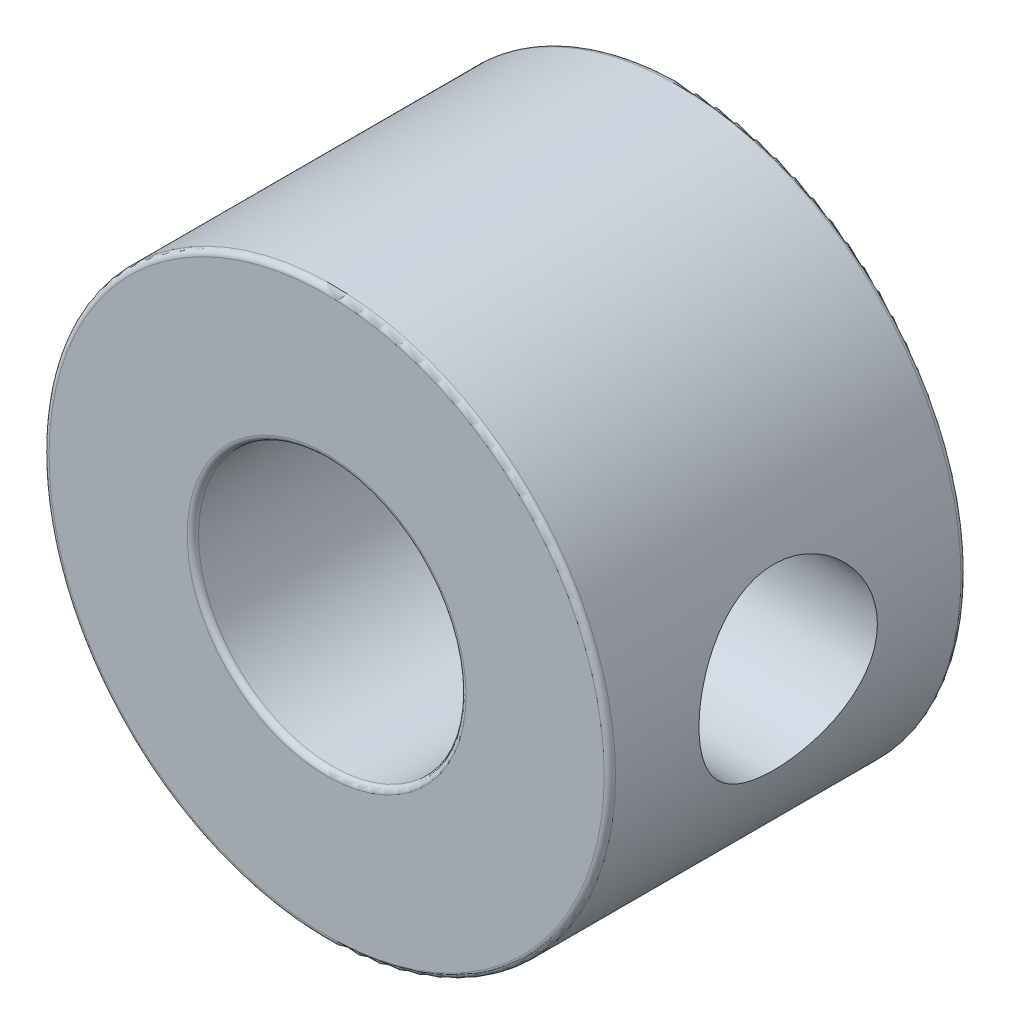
ISO-10303-21;
HEADER;
FILE_DESCRIPTION(('STEP AP214'),'2;1');
FILE_NAME('part.step','',(''),(''),'','','');
FILE_SCHEMA(('AUTOMOTIVE_DESIGN { 1 0 10303 214 1 1 1 1 }'));
ENDSEC;
DATA;
#1=APPLICATION_CONTEXT('core data for automotive mechanical design processes');
#2=APPLICATION_PROTOCOL_DEFINITION('international standard','automotive_design',2000,#1);
#3=PRODUCT_CONTEXT('',#1,'mechanical');
#4=PRODUCT('Part','Part','',(#3));
#5=PRODUCT_RELATED_PRODUCT_CATEGORY('part','',(#4));
#6=PRODUCT_DEFINITION_FORMATION('','',#4);
#7=PRODUCT_DEFINITION_CONTEXT('part definition',#1,'design');
#8=PRODUCT_DEFINITION('design','',#6,#7);
#9=PRODUCT_DEFINITION_SHAPE('','',#8);
#10=(LENGTH_UNIT() NAMED_UNIT(*) SI_UNIT(.MILLI.,.METRE.));
#11=(NAMED_UNIT(*) PLANE_ANGLE_UNIT() SI_UNIT($,.RADIAN.));
#12=(NAMED_UNIT(*) SI_UNIT($,.STERADIAN.) SOLID_ANGLE_UNIT());
#13=UNCERTAINTY_MEASURE_WITH_UNIT(LENGTH_MEASURE(1.E-05),#10,'distance_accuracy_value','');
#14=(GEOMETRIC_REPRESENTATION_CONTEXT(3) GLOBAL_UNCERTAINTY_ASSIGNED_CONTEXT((#13)) GLOBAL_UNIT_ASSIGNED_CONTEXT((#10,
#11,#12)) REPRESENTATION_CONTEXT('',''));
#15=CARTESIAN_POINT('',(0.,0.,0.));
#16=DIRECTION('',(0.,0.,1.));
#17=DIRECTION('',(1.,0.,0.));
#18=AXIS2_PLACEMENT_3D('',#15,#16,#17);
#19=CARTESIAN_POINT('',(0.,0.,8.));
#20=DIRECTION('',(0.,0.,1.));
#21=DIRECTION('',(1.,0.,0.));
#22=AXIS2_PLACEMENT_3D('',#19,#20,#21);
#23=PLANE('',#22);
#24=CARTESIAN_POINT('',(0.,0.,8.));
#25=DIRECTION('',(0.,0.,1.));
#26=DIRECTION('',(1.,0.,0.));
#27=AXIS2_PLACEMENT_3D('',#24,#25,#26);
#28=CIRCLE('',#27,3.127);
#29=CARTESIAN_POINT('',(3.127,0.,8.));
#30=VERTEX_POINT('',#29);
#31=EDGE_CURVE('E45',#30,#30,#28,.F.);
#32=ORIENTED_EDGE('',*,*,#31,.T.);
#33=EDGE_LOOP('',(#32));
#34=FACE_BOUND('',#33,.T.);
#35=CARTESIAN_POINT('',(0.,0.,8.));
#36=DIRECTION('',(0.,0.,1.));
#37=DIRECTION('',(1.,0.,0.));
#38=AXIS2_PLACEMENT_3D('',#35,#36,#37);
#39=CIRCLE('',#38,6.223);
#40=CARTESIAN_POINT('',(6.223,0.,8.));
#41=VERTEX_POINT('',#40);
#42=EDGE_CURVE('E49',#41,#41,#39,.T.);
#43=ORIENTED_EDGE('',*,*,#42,.T.);
#44=EDGE_LOOP('',(#43));
#45=FACE_BOUND('',#44,.T.);
#46=ADVANCED_FACE('F34',(#34,#45),#23,.T.);
#47=CARTESIAN_POINT('',(0.,0.,0.));
#48=DIRECTION('',(0.,0.,1.));
#49=DIRECTION('',(1.,0.,0.));
#50=AXIS2_PLACEMENT_3D('',#47,#48,#49);
#51=PLANE('',#50);
#52=CARTESIAN_POINT('',(0.,0.,0.));
#53=DIRECTION('',(0.,0.,1.));
#54=DIRECTION('',(1.,0.,0.));
#55=AXIS2_PLACEMENT_3D('',#52,#53,#54);
#56=CIRCLE('',#55,3.127);
#57=CARTESIAN_POINT('',(3.127,0.,0.));
#58=VERTEX_POINT('',#57);
#59=EDGE_CURVE('E60',#58,#58,#56,.T.);
#60=ORIENTED_EDGE('',*,*,#59,.T.);
#61=EDGE_LOOP('',(#60));
#62=FACE_BOUND('',#61,.T.);
#63=CARTESIAN_POINT('',(0.,0.,0.));
#64=DIRECTION('',(0.,0.,1.));
#65=DIRECTION('',(1.,0.,0.));
#66=AXIS2_PLACEMENT_3D('',#63,#64,#65);
#67=CIRCLE('',#66,6.223);
#68=CARTESIAN_POINT('',(6.223,0.,0.));
#69=VERTEX_POINT('',#68);
#70=EDGE_CURVE('E63',#69,#69,#67,.F.);
#71=ORIENTED_EDGE('',*,*,#70,.T.);
#72=EDGE_LOOP('',(#71));
#73=FACE_BOUND('',#72,.T.);
#74=ADVANCED_FACE('F97',(#62,#73),#51,.F.);
#75=CARTESIAN_POINT('',(0.,0.,8.));
#76=DIRECTION('',(0.,0.,-1.));
#77=DIRECTION('',(-1.,0.,0.));
#78=AXIS2_PLACEMENT_3D('',#75,#76,#77);
#79=CYLINDRICAL_SURFACE('',#78,6.35);
#80=CARTESIAN_POINT('',(0.,0.,0.127));
#81=DIRECTION('',(0.,0.,1.));
#82=DIRECTION('',(1.,0.,0.));
#83=AXIS2_PLACEMENT_3D('',#80,#81,#82);
#84=CIRCLE('',#83,6.35);
#85=CARTESIAN_POINT('',(6.35,0.,0.127));
#86=VERTEX_POINT('',#85);
#87=EDGE_CURVE('E10',#86,#86,#84,.T.);
#88=ORIENTED_EDGE('',*,*,#87,.T.);
#89=EDGE_LOOP('',(#88));
#90=FACE_BOUND('',#89,.T.);
#91=CARTESIAN_POINT('',(0.,0.,7.873));
#92=DIRECTION('',(0.,0.,1.));
#93=DIRECTION('',(1.,0.,0.));
#94=AXIS2_PLACEMENT_3D('',#91,#92,#93);
#95=CIRCLE('',#94,6.35);
#96=CARTESIAN_POINT('',(6.35,0.,7.873));
#97=VERTEX_POINT('',#96);
#98=EDGE_CURVE('E41',#97,#97,#95,.F.);
#99=ORIENTED_EDGE('',*,*,#98,.T.);
#100=EDGE_LOOP('',(#99));
#101=FACE_BOUND('',#100,.T.);
#102=CARTESIAN_POINT('',(6.35,0.,2.));
#103=CARTESIAN_POINT('',(6.34999954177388,-0.109459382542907,2.00000058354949));
#104=CARTESIAN_POINT('',(6.34714311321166,-0.218925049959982,2.00901558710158));
#105=CARTESIAN_POINT('',(6.33602827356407,-0.434652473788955,2.0447410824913));
#106=CARTESIAN_POINT('',(6.32776871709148,-0.540913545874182,2.07145532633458));
#107=CARTESIAN_POINT('',(6.30674936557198,-0.747089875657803,2.14158716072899));
#108=CARTESIAN_POINT('',(6.2939966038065,-0.847014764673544,2.1849786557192));
#109=CARTESIAN_POINT('',(6.26530583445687,-1.03817017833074,2.287121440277));
#110=CARTESIAN_POINT('',(6.24936730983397,-1.12939928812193,2.34587522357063));
#111=CARTESIAN_POINT('',(6.21543683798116,-1.30343118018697,2.47901136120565));
#112=CARTESIAN_POINT('',(6.19739963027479,-1.38592345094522,2.55378802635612));
#113=CARTESIAN_POINT('',(6.16156531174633,-1.53742831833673,2.71600787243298));
#114=CARTESIAN_POINT('',(6.14376824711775,-1.60643835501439,2.80345345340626));
#115=CARTESIAN_POINT('',(6.10994220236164,-1.73071363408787,2.99122929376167));
#116=CARTESIAN_POINT('',(6.09396900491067,-1.78558916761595,3.09182847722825));
#117=CARTESIAN_POINT('',(6.06628083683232,-1.87751386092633,3.30141198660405));
#118=CARTESIAN_POINT('',(6.05456472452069,-1.91456780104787,3.41039405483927));
#119=CARTESIAN_POINT('',(6.03719105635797,-1.96865797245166,3.63014256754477));
#120=CARTESIAN_POINT('',(6.03135942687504,-1.98627089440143,3.74075291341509));
#121=CARTESIAN_POINT('',(6.02589838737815,-2.00278087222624,3.96350056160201));
#122=CARTESIAN_POINT('',(6.02626729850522,-2.00168299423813,4.0756374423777));
#123=CARTESIAN_POINT('',(6.03301213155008,-1.98125320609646,4.29346796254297));
#124=CARTESIAN_POINT('',(6.03914580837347,-1.96265658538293,4.39923933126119));
#125=CARTESIAN_POINT('',(6.05633519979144,-1.90895021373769,4.60607693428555));
#126=CARTESIAN_POINT('',(6.06739144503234,-1.8738386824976,4.7071426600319));
#127=CARTESIAN_POINT('',(6.09336435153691,-1.78758434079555,4.90344233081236));
#128=CARTESIAN_POINT('',(6.10833567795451,-1.73621215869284,4.99856794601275));
#129=CARTESIAN_POINT('',(6.14042705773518,-1.6190540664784,5.17908872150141));
#130=CARTESIAN_POINT('',(6.15754767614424,-1.55326436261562,5.26448131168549));
#131=CARTESIAN_POINT('',(6.19297824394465,-1.40553948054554,5.42726612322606));
#132=CARTESIAN_POINT('',(6.21130656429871,-1.32299795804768,5.5041051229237));
#133=CARTESIAN_POINT('',(6.24638917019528,-1.14597287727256,5.64298607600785));
#134=CARTESIAN_POINT('',(6.26314333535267,-1.05148840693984,5.70502689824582));
#135=CARTESIAN_POINT('',(6.29337063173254,-0.852181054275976,5.81293320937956));
#136=CARTESIAN_POINT('',(6.30681635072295,-0.747281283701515,5.85866488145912));
#137=CARTESIAN_POINT('',(6.32871380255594,-0.530755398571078,5.93166785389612));
#138=CARTESIAN_POINT('',(6.33716707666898,-0.419131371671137,5.9589448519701));
#139=CARTESIAN_POINT('',(6.34787832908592,-0.197020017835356,5.99331746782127));
#140=CARTESIAN_POINT('',(6.35036604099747,-0.0866594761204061,6.0011618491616));
#141=CARTESIAN_POINT('',(6.34954641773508,0.133813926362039,5.99856019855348));
#142=CARTESIAN_POINT('',(6.34623994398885,0.243926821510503,5.98811688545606));
#143=CARTESIAN_POINT('',(6.33435451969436,0.457878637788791,5.94983646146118));
#144=CARTESIAN_POINT('',(6.325911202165,0.561805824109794,5.92244650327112));
#145=CARTESIAN_POINT('',(6.30474229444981,0.763559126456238,5.85159744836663));
#146=CARTESIAN_POINT('',(6.29201617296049,0.861384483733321,5.80813635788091));
#147=CARTESIAN_POINT('',(6.26319856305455,1.05083641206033,5.70518375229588));
#148=CARTESIAN_POINT('',(6.24703194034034,1.14225110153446,5.64532394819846));
#149=CARTESIAN_POINT('',(6.21318025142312,1.31398832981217,5.51171388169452));
#150=CARTESIAN_POINT('',(6.19549476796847,1.394307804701,5.43795979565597));
#151=CARTESIAN_POINT('',(6.15970098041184,1.54493496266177,5.27513269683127));
#152=CARTESIAN_POINT('',(6.1416043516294,1.61470885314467,5.18556218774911));
#153=CARTESIAN_POINT('',(6.10778048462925,1.73828550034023,4.99559091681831));
#154=CARTESIAN_POINT('',(6.09205321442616,1.79208847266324,4.89519030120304));
#155=CARTESIAN_POINT('',(6.06492137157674,1.88186972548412,4.68659077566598));
#156=CARTESIAN_POINT('',(6.05350088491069,1.91791378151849,4.57842236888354));
#157=CARTESIAN_POINT('',(6.03638058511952,1.97114343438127,4.35711703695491));
#158=CARTESIAN_POINT('',(6.03067855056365,1.98833635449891,4.24398205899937));
#159=CARTESIAN_POINT('',(6.02587471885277,2.00284439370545,4.02154245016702));
#160=CARTESIAN_POINT('',(6.02648176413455,2.00103634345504,3.91230059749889));
#161=CARTESIAN_POINT('',(6.03351893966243,1.97971522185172,3.69575938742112));
#162=CARTESIAN_POINT('',(6.0399487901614,1.96020300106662,3.58845993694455));
#163=CARTESIAN_POINT('',(6.05770205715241,1.90461841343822,3.3804445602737));
#164=CARTESIAN_POINT('',(6.06895005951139,1.86880073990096,3.27965365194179));
#165=CARTESIAN_POINT('',(6.0950519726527,1.78182311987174,3.08543184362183));
#166=CARTESIAN_POINT('',(6.10990662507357,1.7306600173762,2.99200246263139));
#167=CARTESIAN_POINT('',(6.14228296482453,1.61207166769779,2.81114466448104));
#168=CARTESIAN_POINT('',(6.15988705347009,1.54408200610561,2.724101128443));
#169=CARTESIAN_POINT('',(6.19540382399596,1.39475914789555,2.56237483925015));
#170=CARTESIAN_POINT('',(6.21331658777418,1.31342235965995,2.48769542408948));
#171=CARTESIAN_POINT('',(6.24814930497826,1.1364502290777,2.35032141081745));
#172=CARTESIAN_POINT('',(6.26501620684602,1.04042842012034,2.28810970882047));
#173=CARTESIAN_POINT('',(6.29518499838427,0.8387590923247,2.1807921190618));
#174=CARTESIAN_POINT('',(6.30848823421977,0.733115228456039,2.13567976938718));
#175=CARTESIAN_POINT('',(6.32915110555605,0.523924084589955,2.06696118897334));
#176=CARTESIAN_POINT('',(6.33690087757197,0.420884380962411,2.04192397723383));
#177=CARTESIAN_POINT('',(6.34732501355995,0.211898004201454,2.00844484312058));
#178=CARTESIAN_POINT('',(6.35000044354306,0.105951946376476,1.99999943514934));
#179=CARTESIAN_POINT('',(6.35,0.,2.));
#180=B_SPLINE_CURVE_WITH_KNOTS('',3,(#102,#103,#104,#105,#106,#107,#108,#109,#110,#111,#112,
#113,#114,#115,#116,#117,#118,#119,#120,#121,#122,#123,#124,#125,#126,#127,#128,#129,#130,#131,
#132,#133,#134,#135,#136,#137,#138,#139,#140,#141,#142,#143,#144,#145,#146,#147,#148,#149,#150,
#151,#152,#153,#154,#155,#156,#157,#158,#159,#160,#161,#162,#163,#164,#165,#166,#167,#168,#169,
#170,#171,#172,#173,#174,#175,#176,#177,#178,#179),.UNSPECIFIED.,.T.,.F.,(4,2,2,2,2,2,2,2,2,2,2,
2,2,2,2,2,2,2,2,2,2,2,2,2,2,2,2,2,2,2,2,2,2,2,2,2,2,2,4),(0.,0.327988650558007,
0.656046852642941,0.983593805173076,1.31119396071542,1.6480406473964,1.98495123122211,
2.33034249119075,2.67564105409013,3.01039595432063,3.34506021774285,3.66626171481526,
3.98749784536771,4.31348397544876,4.63955598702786,4.9807199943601,5.32191007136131,
5.66583848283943,6.00966066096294,6.34001323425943,6.67031669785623,6.99225602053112,
7.31423529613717,7.64414085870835,7.97413734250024,8.31743010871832,8.6607182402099,
9.00272515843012,9.34459916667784,9.67076879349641,9.99692275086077,10.3181482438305,
10.6394398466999,10.9734721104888,11.3075944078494,11.6528624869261,11.9979999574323,
12.3155454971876,12.6330243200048),.UNSPECIFIED.);
#181=CARTESIAN_POINT('',(6.35,0.,2.));
#182=VERTEX_POINT('',#181);
#183=EDGE_CURVE('E66',#182,#182,#180,.T.);
#184=ORIENTED_EDGE('',*,*,#183,.T.);
#185=EDGE_LOOP('',(#184));
#186=FACE_BOUND('',#185,.T.);
#187=ADVANCED_FACE('F93',(#90,#101,#186),#79,.T.);
#188=CARTESIAN_POINT('',(0.,0.,8.));
#189=DIRECTION('',(0.,0.,-1.));
#190=DIRECTION('',(-1.,0.,0.));
#191=AXIS2_PLACEMENT_3D('',#188,#189,#190);
#192=CYLINDRICAL_SURFACE('',#191,3.);
#193=CARTESIAN_POINT('',(0.,0.,0.127));
#194=DIRECTION('',(0.,0.,1.));
#195=DIRECTION('',(1.,0.,0.));
#196=AXIS2_PLACEMENT_3D('',#193,#194,#195);
#197=CIRCLE('',#196,3.);
#198=CARTESIAN_POINT('',(3.,0.,0.127));
#199=VERTEX_POINT('',#198);
#200=EDGE_CURVE('E54',#199,#199,#197,.F.);
#201=ORIENTED_EDGE('',*,*,#200,.T.);
#202=EDGE_LOOP('',(#201));
#203=FACE_BOUND('',#202,.T.);
#204=CARTESIAN_POINT('',(0.,0.,7.873));
#205=DIRECTION('',(0.,0.,1.));
#206=DIRECTION('',(1.,0.,0.));
#207=AXIS2_PLACEMENT_3D('',#204,#205,#206);
#208=CIRCLE('',#207,3.);
#209=CARTESIAN_POINT('',(3.,0.,7.873));
#210=VERTEX_POINT('',#209);
#211=EDGE_CURVE('E57',#210,#210,#208,.T.);
#212=ORIENTED_EDGE('',*,*,#211,.T.);
#213=EDGE_LOOP('',(#212));
#214=FACE_BOUND('',#213,.T.);
#215=CARTESIAN_POINT('',(3.,0.,2.));
#216=CARTESIAN_POINT('',(3.0000004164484,-0.100484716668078,1.99999945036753));
#217=CARTESIAN_POINT('',(2.99490802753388,-0.200969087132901,2.0076139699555));
#218=CARTESIAN_POINT('',(2.97504652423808,-0.398733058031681,2.03759686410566));
#219=CARTESIAN_POINT('',(2.96027281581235,-0.496011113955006,2.05997224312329));
#220=CARTESIAN_POINT('',(2.92250482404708,-0.684212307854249,2.11810771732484));
#221=CARTESIAN_POINT('',(2.89954905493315,-0.775162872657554,2.15380514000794));
#222=CARTESIAN_POINT('',(2.8472613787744,-0.94941529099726,2.2370633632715));
#223=CARTESIAN_POINT('',(2.8179285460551,-1.03271603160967,2.28462588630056));
#224=CARTESIAN_POINT('',(2.75227329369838,-1.19728470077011,2.39465693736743));
#225=CARTESIAN_POINT('',(2.71556897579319,-1.27778030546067,2.45804786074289));
#226=CARTESIAN_POINT('',(2.63982313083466,-1.42772804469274,2.59573004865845));
#227=CARTESIAN_POINT('',(2.60077830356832,-1.49716405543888,2.67003692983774));
#228=CARTESIAN_POINT('',(2.51728264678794,-1.63422297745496,2.84105236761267));
#229=CARTESIAN_POINT('',(2.47295067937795,-1.6998318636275,2.93944565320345));
#230=CARTESIAN_POINT('',(2.3908414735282,-1.81350357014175,3.14836337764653));
#231=CARTESIAN_POINT('',(2.35305295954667,-1.86159673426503,3.25886640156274));
#232=CARTESIAN_POINT('',(2.2997626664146,-1.92674035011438,3.45671129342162));
#233=CARTESIAN_POINT('',(2.28097627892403,-1.94874447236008,3.54152845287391));
#234=CARTESIAN_POINT('',(2.25257969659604,-1.98150617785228,3.71474450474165));
#235=CARTESIAN_POINT('',(2.24295368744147,-1.99228314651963,3.80313694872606));
#236=CARTESIAN_POINT('',(2.23436605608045,-2.00191364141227,3.98147477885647));
#237=CARTESIAN_POINT('',(2.23544802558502,-2.00071842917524,4.0714250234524));
#238=CARTESIAN_POINT('',(2.24819775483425,-1.98637581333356,4.24963497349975));
#239=CARTESIAN_POINT('',(2.25987448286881,-1.97321828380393,4.33789318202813));
#240=CARTESIAN_POINT('',(2.29127185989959,-1.93664994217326,4.50646705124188));
#241=CARTESIAN_POINT('',(2.31061488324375,-1.91371711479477,4.58696133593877));
#242=CARTESIAN_POINT('',(2.35509622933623,-1.85870118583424,4.74302369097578));
#243=CARTESIAN_POINT('',(2.38023645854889,-1.82661507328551,4.81859013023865));
#244=CARTESIAN_POINT('',(2.43964196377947,-1.74673818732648,4.97902539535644));
#245=CARTESIAN_POINT('',(2.47472317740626,-1.69708052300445,5.06265990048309));
#246=CARTESIAN_POINT('',(2.54691537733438,-1.58668960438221,5.22138339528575));
#247=CARTESIAN_POINT('',(2.58402882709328,-1.52594268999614,5.29646165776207));
#248=CARTESIAN_POINT('',(2.66543343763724,-1.37981165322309,5.45254254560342));
#249=CARTESIAN_POINT('',(2.7095474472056,-1.29193938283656,5.53133404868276));
#250=CARTESIAN_POINT('',(2.79218100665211,-1.10200799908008,5.67319649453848));
#251=CARTESIAN_POINT('',(2.83070577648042,-0.999962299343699,5.73628214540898));
#252=CARTESIAN_POINT('',(2.89145404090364,-0.804857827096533,5.83347771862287));
#253=CARTESIAN_POINT('',(2.91539261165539,-0.713957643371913,5.87084336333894));
#254=CARTESIAN_POINT('',(2.95507719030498,-0.526036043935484,5.93210492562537));
#255=CARTESIAN_POINT('',(2.97083012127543,-0.429019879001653,5.95601222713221));
#256=CARTESIAN_POINT('',(2.99275882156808,-0.230985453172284,5.989161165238));
#257=CARTESIAN_POINT('',(2.99889322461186,-0.129951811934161,5.99833946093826));
#258=CARTESIAN_POINT('',(3.00083114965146,0.0724415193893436,6.00124708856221));
#259=CARTESIAN_POINT('',(2.99663539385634,0.173801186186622,5.99497750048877));
#260=CARTESIAN_POINT('',(2.97899589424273,0.366455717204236,5.96837594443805));
#261=CARTESIAN_POINT('',(2.96622246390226,0.457957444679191,5.94906270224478));
#262=CARTESIAN_POINT('',(2.93318449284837,0.636116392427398,5.89840431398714));
#263=CARTESIAN_POINT('',(2.91291875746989,0.722772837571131,5.86705724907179));
#264=CARTESIAN_POINT('',(2.86496352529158,0.894664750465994,5.79134770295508));
#265=CARTESIAN_POINT('',(2.83689870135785,0.979496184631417,5.74631184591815));
#266=CARTESIAN_POINT('',(2.77601855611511,1.14068302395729,5.64556671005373));
#267=CARTESIAN_POINT('',(2.74320030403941,1.21703314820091,5.58985083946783));
#268=CARTESIAN_POINT('',(2.6695454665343,1.37185445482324,5.45939213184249));
#269=CARTESIAN_POINT('',(2.62826156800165,1.44875187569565,5.38303373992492));
#270=CARTESIAN_POINT('',(2.54571173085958,1.58933968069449,5.21888857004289));
#271=CARTESIAN_POINT('',(2.50444582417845,1.6530209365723,5.1310939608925));
#272=CARTESIAN_POINT('',(2.4293967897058,1.76124776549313,4.95285758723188));
#273=CARTESIAN_POINT('',(2.39527597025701,1.80695636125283,4.86326796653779));
#274=CARTESIAN_POINT('',(2.33438974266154,1.88496213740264,4.67612734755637));
#275=CARTESIAN_POINT('',(2.30761112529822,1.91728345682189,4.57859106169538));
#276=CARTESIAN_POINT('',(2.26933208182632,1.9623584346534,4.39543551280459));
#277=CARTESIAN_POINT('',(2.25594998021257,1.97758597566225,4.31082819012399));
#278=CARTESIAN_POINT('',(2.23879466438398,1.99699205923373,4.13942671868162));
#279=CARTESIAN_POINT('',(2.23501101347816,2.00118260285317,4.05263504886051));
#280=CARTESIAN_POINT('',(2.23764201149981,1.99823921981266,3.87935694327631));
#281=CARTESIAN_POINT('',(2.24406269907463,1.99109858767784,3.79287071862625));
#282=CARTESIAN_POINT('',(2.26610452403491,1.96596997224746,3.62265647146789));
#283=CARTESIAN_POINT('',(2.28173793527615,1.94796751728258,3.53893228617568));
#284=CARTESIAN_POINT('',(2.325268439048,1.89593035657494,3.35428881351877));
#285=CARTESIAN_POINT('',(2.35532333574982,1.85890187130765,3.25473228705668));
#286=CARTESIAN_POINT('',(2.42222161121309,1.77084526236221,3.0645131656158));
#287=CARTESIAN_POINT('',(2.45907449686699,1.71979748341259,2.97386330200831));
#288=CARTESIAN_POINT('',(2.53617186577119,1.60398280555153,2.80071811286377));
#289=CARTESIAN_POINT('',(2.5764658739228,1.53898309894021,2.71840125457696));
#290=CARTESIAN_POINT('',(2.65628301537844,1.39671768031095,2.56467752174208));
#291=CARTESIAN_POINT('',(2.69580590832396,1.31944821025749,2.49327400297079));
#292=CARTESIAN_POINT('',(2.77631551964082,1.14145732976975,2.35328789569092));
#293=CARTESIAN_POINT('',(2.81669805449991,1.03896166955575,2.28658135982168));
#294=CARTESIAN_POINT('',(2.88777665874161,0.820868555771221,2.1720867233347));
#295=CARTESIAN_POINT('',(2.91848793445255,0.705292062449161,2.12426889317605));
#296=CARTESIAN_POINT('',(2.96101644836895,0.491435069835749,2.05884542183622));
#297=CARTESIAN_POINT('',(2.97551480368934,0.395012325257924,2.03688896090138));
#298=CARTESIAN_POINT('',(2.99500280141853,0.199058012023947,2.0074719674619));
#299=CARTESIAN_POINT('',(2.99999958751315,0.0995288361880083,2.00000054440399));
#300=CARTESIAN_POINT('',(3.,0.,2.));
#301=B_SPLINE_CURVE_WITH_KNOTS('',3,(#215,#216,#217,#218,#219,#220,#221,#222,#223,#224,#225,
#226,#227,#228,#229,#230,#231,#232,#233,#234,#235,#236,#237,#238,#239,#240,#241,#242,#243,#244,
#245,#246,#247,#248,#249,#250,#251,#252,#253,#254,#255,#256,#257,#258,#259,#260,#261,#262,#263,
#264,#265,#266,#267,#268,#269,#270,#271,#272,#273,#274,#275,#276,#277,#278,#279,#280,#281,#282,
#283,#284,#285,#286,#287,#288,#289,#290,#291,#292,#293,#294,#295,#296,#297,#298,#299,#300),
.UNSPECIFIED.,.T.,.F.,(4,2,2,2,2,2,2,2,2,2,2,2,2,2,2,2,2,2,2,2,2,2,2,2,2,2,2,2,2,2,2,2,2,2,2,2,
2,2,2,2,2,2,4),(0.,0.3010532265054,0.602249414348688,0.902046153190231,1.20188643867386,
1.52717029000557,1.85292411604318,2.23006683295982,2.60655305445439,2.87433693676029,
3.14165767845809,3.41006711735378,3.67870397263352,3.93548862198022,4.19235783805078,
4.50147574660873,4.81097703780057,5.18718954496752,5.56304840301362,5.86524087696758,
6.16717735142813,6.4704088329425,6.77361911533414,7.05553084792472,7.3374875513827,
7.63652346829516,7.93574454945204,8.28228176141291,8.62905753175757,8.94649935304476,
9.26336626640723,9.52324048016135,9.78283200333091,10.0425772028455,10.302669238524,
10.6320660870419,10.9619271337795,11.2977924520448,11.6337608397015,12.0179535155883,
12.4015390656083,12.6999529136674,12.9981423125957),.UNSPECIFIED.);
#302=CARTESIAN_POINT('',(3.,0.,2.));
#303=VERTEX_POINT('',#302);
#304=EDGE_CURVE('E67',#303,#303,#301,.T.);
#305=ORIENTED_EDGE('',*,*,#304,.F.);
#306=EDGE_LOOP('',(#305));
#307=FACE_BOUND('',#306,.T.);
#308=ADVANCED_FACE('F77',(#203,#214,#307),#192,.F.);
#309=CARTESIAN_POINT('',(-5.65685424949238,0.,4.));
#310=DIRECTION('',(1.,0.,0.));
#311=DIRECTION('',(0.,0.,-1.));
#312=AXIS2_PLACEMENT_3D('',#309,#310,#311);
#313=CYLINDRICAL_SURFACE('',#312,2.);
#314=ORIENTED_EDGE('',*,*,#304,.T.);
#315=EDGE_LOOP('',(#314));
#316=FACE_BOUND('',#315,.T.);
#317=ORIENTED_EDGE('',*,*,#183,.F.);
#318=EDGE_LOOP('',(#317));
#319=FACE_BOUND('',#318,.T.);
#320=ADVANCED_FACE('F80',(#316,#319),#313,.F.);
#321=CARTESIAN_POINT('',(0.,0.,0.127));
#322=DIRECTION('',(0.,0.,1.));
#323=DIRECTION('',(1.,0.,0.));
#324=AXIS2_PLACEMENT_3D('',#321,#322,#323);
#325=TOROIDAL_SURFACE('',#324,3.127,0.127);
#326=ORIENTED_EDGE('',*,*,#200,.F.);
#327=EDGE_LOOP('',(#326));
#328=FACE_BOUND('',#327,.T.);
#329=ORIENTED_EDGE('',*,*,#59,.F.);
#330=EDGE_LOOP('',(#329));
#331=FACE_BOUND('',#330,.T.);
#332=ADVANCED_FACE('F83',(#328,#331),#325,.T.);
#333=CARTESIAN_POINT('',(0.,0.,7.873));
#334=DIRECTION('',(0.,0.,1.));
#335=DIRECTION('',(1.,0.,0.));
#336=AXIS2_PLACEMENT_3D('',#333,#334,#335);
#337=TOROIDAL_SURFACE('',#336,3.127,0.127);
#338=ORIENTED_EDGE('',*,*,#31,.F.);
#339=EDGE_LOOP('',(#338));
#340=FACE_BOUND('',#339,.T.);
#341=ORIENTED_EDGE('',*,*,#211,.F.);
#342=EDGE_LOOP('',(#341));
#343=FACE_BOUND('',#342,.T.);
#344=ADVANCED_FACE('F90',(#340,#343),#337,.T.);
#345=CARTESIAN_POINT('',(0.,0.,0.127));
#346=DIRECTION('',(0.,0.,1.));
#347=DIRECTION('',(1.,0.,0.));
#348=AXIS2_PLACEMENT_3D('',#345,#346,#347);
#349=TOROIDAL_SURFACE('',#348,6.223,0.127);
#350=ORIENTED_EDGE('',*,*,#70,.F.);
#351=EDGE_LOOP('',(#350));
#352=FACE_BOUND('',#351,.T.);
#353=ORIENTED_EDGE('',*,*,#87,.F.);
#354=EDGE_LOOP('',(#353));
#355=FACE_BOUND('',#354,.T.);
#356=ADVANCED_FACE('F109',(#352,#355),#349,.T.);
#357=CARTESIAN_POINT('',(0.,0.,7.873));
#358=DIRECTION('',(0.,0.,1.));
#359=DIRECTION('',(1.,0.,0.));
#360=AXIS2_PLACEMENT_3D('',#357,#358,#359);
#361=TOROIDAL_SURFACE('',#360,6.223,0.127);
#362=ORIENTED_EDGE('',*,*,#98,.F.);
#363=EDGE_LOOP('',(#362));
#364=FACE_BOUND('',#363,.T.);
#365=ORIENTED_EDGE('',*,*,#42,.F.);
#366=EDGE_LOOP('',(#365));
#367=FACE_BOUND('',#366,.T.);
#368=ADVANCED_FACE('F36',(#364,#367),#361,.T.);
#369=CLOSED_SHELL('',(#46,#74,#187,#308,#320,#332,#344,#356,#368));
#370=MANIFOLD_SOLID_BREP('B2',#369);
#371=ADVANCED_BREP_SHAPE_REPRESENTATION('',(#18,#370),#14);
#372=SHAPE_DEFINITION_REPRESENTATION(#9,#371);
ENDSEC;
END-ISO-10303-21;
